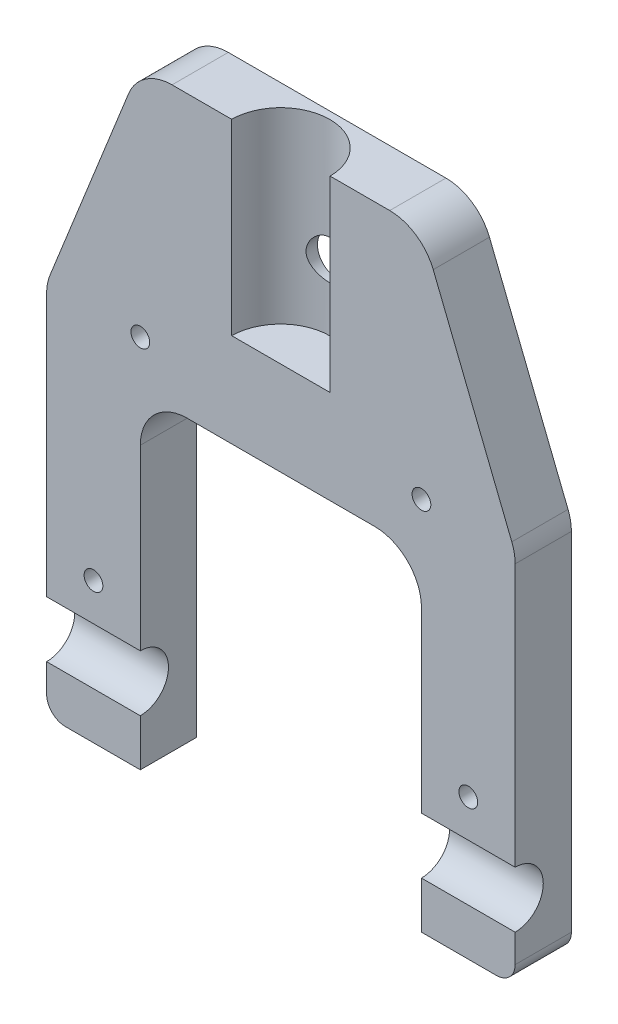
from build123d import *

# Parameters (mm, degrees)
ESQUISSE1_R             = 2.1
EXTRUSION1_DEPTH        = 6
ESQUISSE4_R             = 5.25
ENL_V_MAT_EXTRU_2_DEPTH = 20
ENL_V_MAT_EXTRU_3_DEPTH = 10
ESQUISSE6_R             = 3
ENL_V_MAT_EXTRU_4_DEPTH = 83.225300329
ESQUISSE7_R             = 1
ENL_V_MAT_EXTRU_5_DEPTH = 3


with BuildPart() as part:
    # Esquisse1 → Extrusion1 (new body)
    with BuildSketch(Plane.XY):
        with BuildLine():
            Line((0, 2), (0, 39.037087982))
            ThreePointArc((0, 39.037087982), (0.090218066, 39.982625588), (0.357616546, 40.894041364))
            Line((0.357616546, 40.894041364), (8.742781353, 61.856953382))
            ThreePointArc((8.742781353, 61.856953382), (10.582020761, 64.140336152), (13.385164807, 65))
            Line((13.385164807, 65), (36.614835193, 65))
            ThreePointArc((36.614835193, 65), (39.417979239, 64.140336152), (41.257218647, 61.856953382))
            Line((41.257218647, 61.856953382), (49.642383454, 40.894041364))
            ThreePointArc((49.642383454, 40.894041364), (49.909781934, 39.982625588), (50, 39.037087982))
            Line((50, 39.037087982), (50, 2))
            ThreePointArc((50, 2), (49.414213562, 0.585786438), (48, 0))
            Line((48, 0), (2, 0))
            ThreePointArc((2, 0), (0.585786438, 0.585786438), (0, 2))
        make_face()
        with Locations((25, 52)):
            Circle(ESQUISSE1_R, mode=Mode.SUBTRACT)
    extrude(amount=EXTRUSION1_DEPTH)

    # Esquisse4 → Enl_v. mat.-Extru.2 (cut)
    with BuildSketch(Plane(origin=(0, 65, 0), x_dir=(-1, 0, 0), z_dir=(0, 1, 0))):
        with Locations((-25, 6.026163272)):
            Circle(ESQUISSE4_R)
    extrude(amount=-ENL_V_MAT_EXTRU_2_DEPTH, mode=Mode.SUBTRACT)

    # Esquisse5 → Enl_v. mat.-Extru.3 (cut)
    with BuildSketch(Plane.XY.offset(6)):
        with BuildLine():
            Line((15, 35), (35, 35))
            ThreePointArc((35, 35), (38.535533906, 33.535533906), (40, 30))
            Line((40, 30), (40, 0))
            Line((40, 0), (10, 0))
            Line((10, 0), (10, 30))
            ThreePointArc((10, 30), (11.464466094, 33.535533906), (15, 35))
        make_face()
    extrude(amount=-ENL_V_MAT_EXTRU_3_DEPTH, mode=Mode.SUBTRACT)

    # Esquisse6 → Enl_v. mat.-Extru.4 (cut, through all)
    with BuildSketch(Plane(origin=(50, 0, 0), x_dir=(0, 0, -1), z_dir=(1, 0, 0))):
        with Locations((-6, 8)):
            Circle(ESQUISSE6_R)
    extrude(amount=-ENL_V_MAT_EXTRU_4_DEPTH, mode=Mode.SUBTRACT)

    # Esquisse7 → Enl_v. mat.-Extru.5 (cut)
    with BuildSketch(Plane.XY.offset(6)):
        with Locations((5, 15)):
            Circle(ESQUISSE7_R)
        with Locations((10, 40)):
            Circle(ESQUISSE7_R)
        with Locations(Location((45, 15, 0), (0, 0, 180))):
            Circle(ESQUISSE7_R)
        with Locations(Location((40, 40, 0), (0, 0, 180))):
            Circle(ESQUISSE7_R)
    extrude(amount=-ENL_V_MAT_EXTRU_5_DEPTH, mode=Mode.SUBTRACT)


solid = part.part
